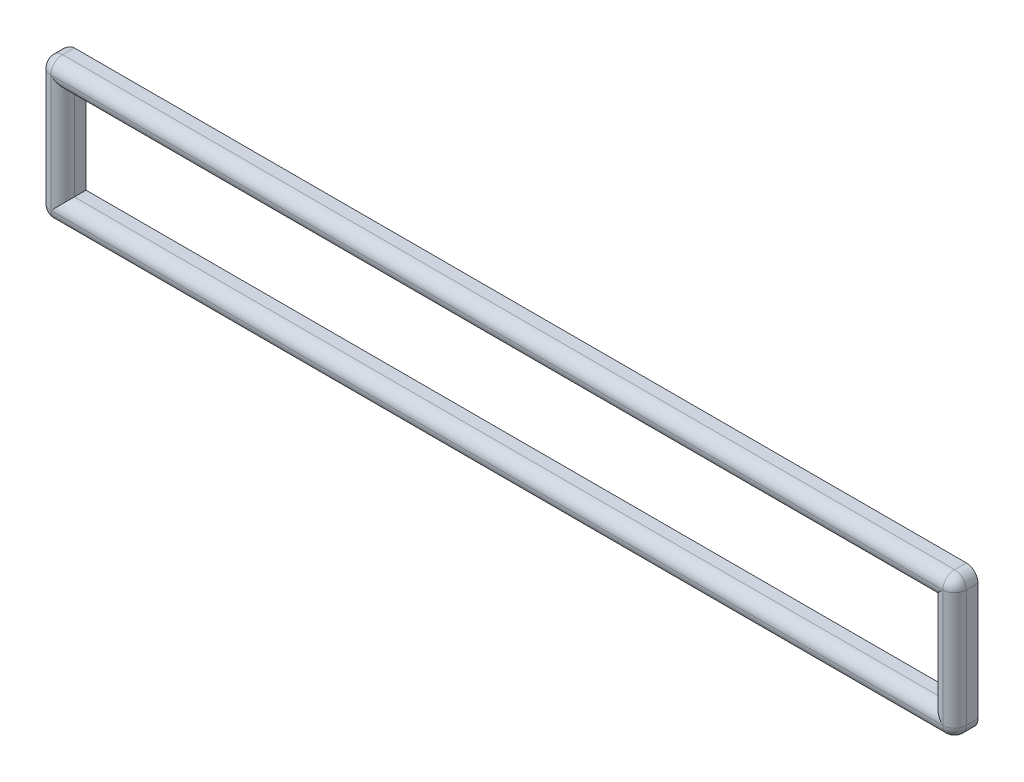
ISO-10303-21;
HEADER;
FILE_DESCRIPTION(('STEP AP214'),'2;1');
FILE_NAME('part.step','',(''),(''),'','','');
FILE_SCHEMA(('AUTOMOTIVE_DESIGN { 1 0 10303 214 1 1 1 1 }'));
ENDSEC;
DATA;
#1=APPLICATION_CONTEXT('core data for automotive mechanical design processes');
#2=APPLICATION_PROTOCOL_DEFINITION('international standard','automotive_design',2000,#1);
#3=PRODUCT_CONTEXT('',#1,'mechanical');
#4=PRODUCT('Part','Part','',(#3));
#5=PRODUCT_RELATED_PRODUCT_CATEGORY('part','',(#4));
#6=PRODUCT_DEFINITION_FORMATION('','',#4);
#7=PRODUCT_DEFINITION_CONTEXT('part definition',#1,'design');
#8=PRODUCT_DEFINITION('design','',#6,#7);
#9=PRODUCT_DEFINITION_SHAPE('','',#8);
#10=(LENGTH_UNIT() NAMED_UNIT(*) SI_UNIT(.MILLI.,.METRE.));
#11=(NAMED_UNIT(*) PLANE_ANGLE_UNIT() SI_UNIT($,.RADIAN.));
#12=(NAMED_UNIT(*) SI_UNIT($,.STERADIAN.) SOLID_ANGLE_UNIT());
#13=UNCERTAINTY_MEASURE_WITH_UNIT(LENGTH_MEASURE(1.E-05),#10,'distance_accuracy_value','');
#14=(GEOMETRIC_REPRESENTATION_CONTEXT(3) GLOBAL_UNCERTAINTY_ASSIGNED_CONTEXT((#13)) GLOBAL_UNIT_ASSIGNED_CONTEXT((#10,
#11,#12)) REPRESENTATION_CONTEXT('',''));
#15=CARTESIAN_POINT('',(0.,0.,0.));
#16=DIRECTION('',(0.,0.,1.));
#17=DIRECTION('',(1.,0.,0.));
#18=AXIS2_PLACEMENT_3D('',#15,#16,#17);
#19=CARTESIAN_POINT('',(49.53,7.62,2.54));
#20=DIRECTION('',(-1.,0.,0.));
#21=DIRECTION('',(0.,-1.,0.));
#22=AXIS2_PLACEMENT_3D('',#19,#20,#21);
#23=PLANE('',#22);
#24=DIRECTION('',(0.,1.,0.));
#25=VECTOR('',#24,1.);
#26=CARTESIAN_POINT('',(49.53,-7.62,1.27));
#27=LINE('',#26,#25);
#28=CARTESIAN_POINT('',(49.53,6.35,1.27));
#29=VERTEX_POINT('',#28);
#30=CARTESIAN_POINT('',(49.53,-6.35,1.27));
#31=VERTEX_POINT('',#30);
#32=EDGE_CURVE('E233',#29,#31,#27,.F.);
#33=ORIENTED_EDGE('',*,*,#32,.T.);
#34=DIRECTION('',(0.,0.,-1.));
#35=VECTOR('',#34,1.);
#36=CARTESIAN_POINT('',(49.53,-6.35,2.54));
#37=LINE('',#36,#35);
#38=CARTESIAN_POINT('',(49.53,-6.35,0.));
#39=VERTEX_POINT('',#38);
#40=EDGE_CURVE('E165',#31,#39,#37,.T.);
#41=ORIENTED_EDGE('',*,*,#40,.T.);
#42=DIRECTION('',(0.,1.,0.));
#43=VECTOR('',#42,1.);
#44=CARTESIAN_POINT('',(49.53,7.62,0.));
#45=LINE('',#44,#43);
#46=CARTESIAN_POINT('',(49.53,6.35,0.));
#47=VERTEX_POINT('',#46);
#48=EDGE_CURVE('E155',#39,#47,#45,.T.);
#49=ORIENTED_EDGE('',*,*,#48,.T.);
#50=DIRECTION('',(0.,0.,-1.));
#51=VECTOR('',#50,1.);
#52=CARTESIAN_POINT('',(49.53,6.35,2.54));
#53=LINE('',#52,#51);
#54=EDGE_CURVE('E235',#47,#29,#53,.F.);
#55=ORIENTED_EDGE('',*,*,#54,.T.);
#56=EDGE_LOOP('',(#33,#41,#49,#55));
#57=FACE_BOUND('',#56,.T.);
#58=ADVANCED_FACE('F35',(#57),#23,.F.);
#59=CARTESIAN_POINT('',(-49.53,7.62,2.54));
#60=DIRECTION('',(0.,-1.,0.));
#61=DIRECTION('',(1.,0.,0.));
#62=AXIS2_PLACEMENT_3D('',#59,#60,#61);
#63=PLANE('',#62);
#64=DIRECTION('',(-1.,0.,0.));
#65=VECTOR('',#64,1.);
#66=CARTESIAN_POINT('',(-49.53,7.62,0.));
#67=LINE('',#66,#65);
#68=CARTESIAN_POINT('',(48.26,7.62,0.));
#69=VERTEX_POINT('',#68);
#70=CARTESIAN_POINT('',(-48.26,7.62,0.));
#71=VERTEX_POINT('',#70);
#72=EDGE_CURVE('E200',#69,#71,#67,.T.);
#73=ORIENTED_EDGE('',*,*,#72,.T.);
#74=DIRECTION('',(0.,0.,-1.));
#75=VECTOR('',#74,1.);
#76=CARTESIAN_POINT('',(-48.26,7.62,2.54));
#77=LINE('',#76,#75);
#78=CARTESIAN_POINT('',(-48.26,7.62,1.27));
#79=VERTEX_POINT('',#78);
#80=EDGE_CURVE('E227',#71,#79,#77,.F.);
#81=ORIENTED_EDGE('',*,*,#80,.T.);
#82=DIRECTION('',(-1.,0.,0.));
#83=VECTOR('',#82,1.);
#84=CARTESIAN_POINT('',(49.53,7.62,1.27));
#85=LINE('',#84,#83);
#86=CARTESIAN_POINT('',(48.26,7.62,1.27));
#87=VERTEX_POINT('',#86);
#88=EDGE_CURVE('E209',#79,#87,#85,.F.);
#89=ORIENTED_EDGE('',*,*,#88,.T.);
#90=DIRECTION('',(0.,0.,-1.));
#91=VECTOR('',#90,1.);
#92=CARTESIAN_POINT('',(48.26,7.62,2.54));
#93=LINE('',#92,#91);
#94=EDGE_CURVE('E225',#87,#69,#93,.T.);
#95=ORIENTED_EDGE('',*,*,#94,.T.);
#96=EDGE_LOOP('',(#73,#81,#89,#95));
#97=FACE_BOUND('',#96,.T.);
#98=ADVANCED_FACE('F323',(#97),#63,.F.);
#99=CARTESIAN_POINT('',(-49.53,-7.62,2.54));
#100=DIRECTION('',(0.,1.,0.));
#101=DIRECTION('',(0.,0.,1.));
#102=AXIS2_PLACEMENT_3D('',#99,#100,#101);
#103=PLANE('',#102);
#104=DIRECTION('',(1.,0.,0.));
#105=VECTOR('',#104,1.);
#106=CARTESIAN_POINT('',(-49.53,-7.62,1.27));
#107=LINE('',#106,#105);
#108=CARTESIAN_POINT('',(48.26,-7.62,1.27));
#109=VERTEX_POINT('',#108);
#110=CARTESIAN_POINT('',(-48.26,-7.62,1.27));
#111=VERTEX_POINT('',#110);
#112=EDGE_CURVE('E214',#109,#111,#107,.F.);
#113=ORIENTED_EDGE('',*,*,#112,.T.);
#114=DIRECTION('',(0.,0.,-1.));
#115=VECTOR('',#114,1.);
#116=CARTESIAN_POINT('',(-48.26,-7.62,2.54));
#117=LINE('',#116,#115);
#118=CARTESIAN_POINT('',(-48.26,-7.62,0.));
#119=VERTEX_POINT('',#118);
#120=EDGE_CURVE('E216',#111,#119,#117,.T.);
#121=ORIENTED_EDGE('',*,*,#120,.T.);
#122=DIRECTION('',(1.,0.,0.));
#123=VECTOR('',#122,1.);
#124=CARTESIAN_POINT('',(-49.53,-7.62,0.));
#125=LINE('',#124,#123);
#126=CARTESIAN_POINT('',(48.26,-7.62,0.));
#127=VERTEX_POINT('',#126);
#128=EDGE_CURVE('E203',#119,#127,#125,.T.);
#129=ORIENTED_EDGE('',*,*,#128,.T.);
#130=DIRECTION('',(0.,0.,-1.));
#131=VECTOR('',#130,1.);
#132=CARTESIAN_POINT('',(48.26,-7.62,2.54));
#133=LINE('',#132,#131);
#134=EDGE_CURVE('E212',#127,#109,#133,.F.);
#135=ORIENTED_EDGE('',*,*,#134,.T.);
#136=EDGE_LOOP('',(#113,#121,#129,#135));
#137=FACE_BOUND('',#136,.T.);
#138=ADVANCED_FACE('F303',(#137),#103,.F.);
#139=CARTESIAN_POINT('',(0.,0.,0.));
#140=DIRECTION('',(0.,0.,1.));
#141=DIRECTION('',(1.,0.,0.));
#142=AXIS2_PLACEMENT_3D('',#139,#140,#141);
#143=PLANE('',#142);
#144=DIRECTION('',(1.,0.,0.));
#145=VECTOR('',#144,1.);
#146=CARTESIAN_POINT('',(-46.99,-5.08,0.));
#147=LINE('',#146,#145);
#148=CARTESIAN_POINT('',(-46.99,-5.08,0.));
#149=VERTEX_POINT('',#148);
#150=CARTESIAN_POINT('',(46.99,-5.08,0.));
#151=VERTEX_POINT('',#150);
#152=EDGE_CURVE('E192',#149,#151,#147,.T.);
#153=ORIENTED_EDGE('',*,*,#152,.T.);
#154=DIRECTION('',(0.,1.,0.));
#155=VECTOR('',#154,1.);
#156=CARTESIAN_POINT('',(46.99,5.08,0.));
#157=LINE('',#156,#155);
#158=CARTESIAN_POINT('',(46.99,5.08,0.));
#159=VERTEX_POINT('',#158);
#160=EDGE_CURVE('E153',#151,#159,#157,.T.);
#161=ORIENTED_EDGE('',*,*,#160,.T.);
#162=DIRECTION('',(-1.,0.,0.));
#163=VECTOR('',#162,1.);
#164=CARTESIAN_POINT('',(-46.99,5.08,0.));
#165=LINE('',#164,#163);
#166=CARTESIAN_POINT('',(-46.99,5.08,0.));
#167=VERTEX_POINT('',#166);
#168=EDGE_CURVE('E183',#159,#167,#165,.T.);
#169=ORIENTED_EDGE('',*,*,#168,.T.);
#170=DIRECTION('',(0.,-1.,0.));
#171=VECTOR('',#170,1.);
#172=CARTESIAN_POINT('',(-46.99,5.08,0.));
#173=LINE('',#172,#171);
#174=EDGE_CURVE('E187',#167,#149,#173,.T.);
#175=ORIENTED_EDGE('',*,*,#174,.T.);
#176=EDGE_LOOP('',(#153,#161,#169,#175));
#177=FACE_BOUND('',#176,.T.);
#178=ORIENTED_EDGE('',*,*,#128,.F.);
#179=DIRECTION('',(0.,-1.,0.));
#180=VECTOR('',#179,1.);
#181=CARTESIAN_POINT('',(-48.26,0.,0.));
#182=LINE('',#181,#180);
#183=EDGE_CURVE('E223',#119,#71,#182,.F.);
#184=ORIENTED_EDGE('',*,*,#183,.T.);
#185=ORIENTED_EDGE('',*,*,#72,.F.);
#186=CARTESIAN_POINT('',(48.26,6.35,0.));
#187=DIRECTION('',(0.,0.,1.));
#188=DIRECTION('',(1.,0.,0.));
#189=AXIS2_PLACEMENT_3D('',#186,#187,#188);
#190=CIRCLE('',#189,1.27);
#191=EDGE_CURVE('E219',#69,#47,#190,.F.);
#192=ORIENTED_EDGE('',*,*,#191,.T.);
#193=ORIENTED_EDGE('',*,*,#48,.F.);
#194=CARTESIAN_POINT('',(48.26,-6.35,0.));
#195=DIRECTION('',(0.,0.,1.));
#196=DIRECTION('',(1.,0.,0.));
#197=AXIS2_PLACEMENT_3D('',#194,#195,#196);
#198=CIRCLE('',#197,1.27);
#199=EDGE_CURVE('E221',#39,#127,#198,.F.);
#200=ORIENTED_EDGE('',*,*,#199,.T.);
#201=EDGE_LOOP('',(#178,#184,#185,#192,#193,#200));
#202=FACE_BOUND('',#201,.T.);
#203=ADVANCED_FACE('F300',(#177,#202),#143,.F.);
#204=CARTESIAN_POINT('',(46.99,5.08,0.));
#205=DIRECTION('',(1.,0.,0.));
#206=DIRECTION('',(0.,0.,-1.));
#207=AXIS2_PLACEMENT_3D('',#204,#205,#206);
#208=PLANE('',#207);
#209=DIRECTION('',(0.,0.,1.));
#210=VECTOR('',#209,1.);
#211=CARTESIAN_POINT('',(46.99,-5.08,0.));
#212=LINE('',#211,#210);
#213=CARTESIAN_POINT('',(46.99,-5.08,1.27));
#214=VERTEX_POINT('',#213);
#215=EDGE_CURVE('E146',#151,#214,#212,.T.);
#216=ORIENTED_EDGE('',*,*,#215,.T.);
#217=DIRECTION('',(0.,1.,0.));
#218=VECTOR('',#217,1.);
#219=CARTESIAN_POINT('',(46.99,5.08,1.27));
#220=LINE('',#219,#218);
#221=CARTESIAN_POINT('',(46.99,5.08,1.27));
#222=VERTEX_POINT('',#221);
#223=EDGE_CURVE('E151',#214,#222,#220,.T.);
#224=ORIENTED_EDGE('',*,*,#223,.T.);
#225=DIRECTION('',(0.,0.,1.));
#226=VECTOR('',#225,1.);
#227=CARTESIAN_POINT('',(46.99,5.08,0.));
#228=LINE('',#227,#226);
#229=EDGE_CURVE('E88',#159,#222,#228,.T.);
#230=ORIENTED_EDGE('',*,*,#229,.F.);
#231=ORIENTED_EDGE('',*,*,#160,.F.);
#232=EDGE_LOOP('',(#216,#224,#230,#231));
#233=FACE_BOUND('',#232,.T.);
#234=ADVANCED_FACE('F150',(#233),#208,.F.);
#235=CARTESIAN_POINT('',(-46.99,-5.08,0.));
#236=DIRECTION('',(0.,-1.,0.));
#237=DIRECTION('',(0.,0.,-1.));
#238=AXIS2_PLACEMENT_3D('',#235,#236,#237);
#239=PLANE('',#238);
#240=DIRECTION('',(0.,0.,1.));
#241=VECTOR('',#240,1.);
#242=CARTESIAN_POINT('',(-46.99,-5.08,0.));
#243=LINE('',#242,#241);
#244=CARTESIAN_POINT('',(-46.99,-5.08,1.27));
#245=VERTEX_POINT('',#244);
#246=EDGE_CURVE('E147',#149,#245,#243,.T.);
#247=ORIENTED_EDGE('',*,*,#246,.T.);
#248=DIRECTION('',(1.,0.,0.));
#249=VECTOR('',#248,1.);
#250=CARTESIAN_POINT('',(46.99,-5.08,1.27));
#251=LINE('',#250,#249);
#252=EDGE_CURVE('E11',#245,#214,#251,.T.);
#253=ORIENTED_EDGE('',*,*,#252,.T.);
#254=ORIENTED_EDGE('',*,*,#215,.F.);
#255=ORIENTED_EDGE('',*,*,#152,.F.);
#256=EDGE_LOOP('',(#247,#253,#254,#255));
#257=FACE_BOUND('',#256,.T.);
#258=ADVANCED_FACE('F144',(#257),#239,.F.);
#259=CARTESIAN_POINT('',(-46.99,5.08,0.));
#260=DIRECTION('',(-1.,0.,0.));
#261=DIRECTION('',(0.,0.,1.));
#262=AXIS2_PLACEMENT_3D('',#259,#260,#261);
#263=PLANE('',#262);
#264=DIRECTION('',(0.,0.,1.));
#265=VECTOR('',#264,1.);
#266=CARTESIAN_POINT('',(-46.99,5.08,0.));
#267=LINE('',#266,#265);
#268=CARTESIAN_POINT('',(-46.99,5.08,1.27));
#269=VERTEX_POINT('',#268);
#270=EDGE_CURVE('E195',#167,#269,#267,.T.);
#271=ORIENTED_EDGE('',*,*,#270,.T.);
#272=DIRECTION('',(0.,-1.,0.));
#273=VECTOR('',#272,1.);
#274=CARTESIAN_POINT('',(-46.99,-5.08,1.27));
#275=LINE('',#274,#273);
#276=EDGE_CURVE('E45',#269,#245,#275,.T.);
#277=ORIENTED_EDGE('',*,*,#276,.T.);
#278=ORIENTED_EDGE('',*,*,#246,.F.);
#279=ORIENTED_EDGE('',*,*,#174,.F.);
#280=EDGE_LOOP('',(#271,#277,#278,#279));
#281=FACE_BOUND('',#280,.T.);
#282=ADVANCED_FACE('F299',(#281),#263,.F.);
#283=CARTESIAN_POINT('',(-46.99,5.08,0.));
#284=DIRECTION('',(0.,1.,0.));
#285=DIRECTION('',(0.,0.,1.));
#286=AXIS2_PLACEMENT_3D('',#283,#284,#285);
#287=PLANE('',#286);
#288=ORIENTED_EDGE('',*,*,#229,.T.);
#289=DIRECTION('',(-1.,0.,0.));
#290=VECTOR('',#289,1.);
#291=CARTESIAN_POINT('',(-46.99,5.08,1.27));
#292=LINE('',#291,#290);
#293=EDGE_CURVE('E164',#222,#269,#292,.T.);
#294=ORIENTED_EDGE('',*,*,#293,.T.);
#295=ORIENTED_EDGE('',*,*,#270,.F.);
#296=ORIENTED_EDGE('',*,*,#168,.F.);
#297=EDGE_LOOP('',(#288,#294,#295,#296));
#298=FACE_BOUND('',#297,.T.);
#299=ADVANCED_FACE('F298',(#298),#287,.F.);
#300=CARTESIAN_POINT('',(0.,6.35,1.27));
#301=DIRECTION('',(1.,0.,0.));
#302=DIRECTION('',(0.,1.,0.));
#303=AXIS2_PLACEMENT_3D('',#300,#301,#302);
#304=CYLINDRICAL_SURFACE('',#303,1.27);
#305=ORIENTED_EDGE('',*,*,#88,.F.);
#306=CARTESIAN_POINT('',(-48.26,6.35,1.27));
#307=DIRECTION('',(1.,0.,0.));
#308=DIRECTION('',(0.,1.,0.));
#309=AXIS2_PLACEMENT_3D('',#306,#307,#308);
#310=CIRCLE('',#309,1.27);
#311=CARTESIAN_POINT('',(-48.26,6.35,2.54));
#312=VERTEX_POINT('',#311);
#313=EDGE_CURVE('E231',#79,#312,#310,.T.);
#314=ORIENTED_EDGE('',*,*,#313,.T.);
#315=DIRECTION('',(-1.,0.,0.));
#316=VECTOR('',#315,1.);
#317=CARTESIAN_POINT('',(-49.53,6.35,2.54));
#318=LINE('',#317,#316);
#319=CARTESIAN_POINT('',(48.26,6.35,2.54));
#320=VERTEX_POINT('',#319);
#321=EDGE_CURVE('E206',#320,#312,#318,.T.);
#322=ORIENTED_EDGE('',*,*,#321,.F.);
#323=CARTESIAN_POINT('',(48.26,6.35,1.27));
#324=DIRECTION('',(1.,0.,0.));
#325=DIRECTION('',(0.,1.,0.));
#326=AXIS2_PLACEMENT_3D('',#323,#324,#325);
#327=CIRCLE('',#326,1.27);
#328=EDGE_CURVE('E229',#320,#87,#327,.F.);
#329=ORIENTED_EDGE('',*,*,#328,.T.);
#330=EDGE_LOOP('',(#305,#314,#322,#329));
#331=FACE_BOUND('',#330,.T.);
#332=ADVANCED_FACE('F325',(#331),#304,.T.);
#333=CARTESIAN_POINT('',(48.26,6.35,2.54));
#334=DIRECTION('',(0.,0.,-1.));
#335=DIRECTION('',(-1.,0.,0.));
#336=AXIS2_PLACEMENT_3D('',#333,#334,#335);
#337=CYLINDRICAL_SURFACE('',#336,1.27);
#338=ORIENTED_EDGE('',*,*,#191,.F.);
#339=ORIENTED_EDGE('',*,*,#94,.F.);
#340=CARTESIAN_POINT('',(48.26,6.35,1.27));
#341=DIRECTION('',(0.,0.,1.));
#342=DIRECTION('',(1.,0.,0.));
#343=AXIS2_PLACEMENT_3D('',#340,#341,#342);
#344=CIRCLE('',#343,1.27);
#345=EDGE_CURVE('E39',#29,#87,#344,.T.);
#346=ORIENTED_EDGE('',*,*,#345,.F.);
#347=ORIENTED_EDGE('',*,*,#54,.F.);
#348=EDGE_LOOP('',(#338,#339,#346,#347));
#349=FACE_BOUND('',#348,.T.);
#350=ADVANCED_FACE('F37',(#349),#337,.T.);
#351=CARTESIAN_POINT('',(48.26,6.35,1.27));
#352=DIRECTION('',(-1.,0.,0.));
#353=DIRECTION('',(0.,-1.,0.));
#354=AXIS2_PLACEMENT_3D('',#351,#352,#353);
#355=SPHERICAL_SURFACE('',#354,1.27);
#356=ORIENTED_EDGE('',*,*,#345,.T.);
#357=ORIENTED_EDGE('',*,*,#328,.F.);
#358=CARTESIAN_POINT('',(48.26,6.35,1.27));
#359=DIRECTION('',(0.,-1.,0.));
#360=DIRECTION('',(1.,0.,0.));
#361=AXIS2_PLACEMENT_3D('',#358,#359,#360);
#362=CIRCLE('',#361,1.27);
#363=EDGE_CURVE('E172',#29,#320,#362,.T.);
#364=ORIENTED_EDGE('',*,*,#363,.F.);
#365=EDGE_LOOP('',(#356,#357,#364));
#366=FACE_BOUND('',#365,.T.);
#367=ADVANCED_FACE('F290',(#366),#355,.T.);
#368=CARTESIAN_POINT('',(48.26,5.08,1.27));
#369=DIRECTION('',(0.,-1.,0.));
#370=DIRECTION('',(0.,0.,-1.));
#371=AXIS2_PLACEMENT_3D('',#368,#369,#370);
#372=CYLINDRICAL_SURFACE('',#371,1.27);
#373=DIRECTION('',(0.,1.,0.));
#374=VECTOR('',#373,1.);
#375=CARTESIAN_POINT('',(48.26,-5.08,2.54));
#376=LINE('',#375,#374);
#377=CARTESIAN_POINT('',(48.26,-6.35,2.54));
#378=VERTEX_POINT('',#377);
#379=EDGE_CURVE('E79',#320,#378,#376,.F.);
#380=ORIENTED_EDGE('',*,*,#379,.F.);
#381=CARTESIAN_POINT('',(48.26,6.35,1.27));
#382=DIRECTION('',(0.707106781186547,-0.707106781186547,0.));
#383=DIRECTION('',(-0.707106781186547,-0.707106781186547,0.));
#384=AXIS2_PLACEMENT_3D('',#381,#382,#383);
#385=ELLIPSE('',#384,1.79605122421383,1.27);
#386=EDGE_CURVE('E163',#222,#320,#385,.F.);
#387=ORIENTED_EDGE('',*,*,#386,.F.);
#388=ORIENTED_EDGE('',*,*,#223,.F.);
#389=CARTESIAN_POINT('',(48.26,-6.35,1.27));
#390=DIRECTION('',(-0.707106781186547,-0.707106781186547,0.));
#391=DIRECTION('',(0.707106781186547,-0.707106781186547,0.));
#392=AXIS2_PLACEMENT_3D('',#389,#390,#391);
#393=ELLIPSE('',#392,1.79605122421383,1.27);
#394=EDGE_CURVE('E160',#378,#214,#393,.T.);
#395=ORIENTED_EDGE('',*,*,#394,.F.);
#396=EDGE_LOOP('',(#380,#387,#388,#395));
#397=FACE_BOUND('',#396,.T.);
#398=ADVANCED_FACE('F159',(#397),#372,.T.);
#399=CARTESIAN_POINT('',(48.26,0.,1.27));
#400=DIRECTION('',(0.,-1.,0.));
#401=DIRECTION('',(1.,0.,0.));
#402=AXIS2_PLACEMENT_3D('',#399,#400,#401);
#403=CYLINDRICAL_SURFACE('',#402,1.27);
#404=ORIENTED_EDGE('',*,*,#363,.T.);
#405=ORIENTED_EDGE('',*,*,#379,.T.);
#406=CARTESIAN_POINT('',(48.26,-6.35,1.27));
#407=DIRECTION('',(0.,-1.,0.));
#408=DIRECTION('',(0.,0.,-1.));
#409=AXIS2_PLACEMENT_3D('',#406,#407,#408);
#410=CIRCLE('',#409,1.27);
#411=EDGE_CURVE('E170',#31,#378,#410,.T.);
#412=ORIENTED_EDGE('',*,*,#411,.F.);
#413=ORIENTED_EDGE('',*,*,#32,.F.);
#414=EDGE_LOOP('',(#404,#405,#412,#413));
#415=FACE_BOUND('',#414,.T.);
#416=ADVANCED_FACE('F285',(#415),#403,.T.);
#417=CARTESIAN_POINT('',(48.26,-6.35,2.54));
#418=DIRECTION('',(0.,0.,-1.));
#419=DIRECTION('',(-1.,0.,0.));
#420=AXIS2_PLACEMENT_3D('',#417,#418,#419);
#421=CYLINDRICAL_SURFACE('',#420,1.27);
#422=ORIENTED_EDGE('',*,*,#199,.F.);
#423=ORIENTED_EDGE('',*,*,#40,.F.);
#424=CARTESIAN_POINT('',(48.26,-6.35,1.27));
#425=DIRECTION('',(0.,0.,1.));
#426=DIRECTION('',(1.,0.,0.));
#427=AXIS2_PLACEMENT_3D('',#424,#425,#426);
#428=CIRCLE('',#427,1.27);
#429=EDGE_CURVE('E174',#109,#31,#428,.T.);
#430=ORIENTED_EDGE('',*,*,#429,.F.);
#431=ORIENTED_EDGE('',*,*,#134,.F.);
#432=EDGE_LOOP('',(#422,#423,#430,#431));
#433=FACE_BOUND('',#432,.T.);
#434=ADVANCED_FACE('F281',(#433),#421,.T.);
#435=CARTESIAN_POINT('',(-46.99,6.35,1.27));
#436=DIRECTION('',(1.,0.,0.));
#437=DIRECTION('',(0.,0.,-1.));
#438=AXIS2_PLACEMENT_3D('',#435,#436,#437);
#439=CYLINDRICAL_SURFACE('',#438,1.27);
#440=ORIENTED_EDGE('',*,*,#386,.T.);
#441=ORIENTED_EDGE('',*,*,#321,.T.);
#442=CARTESIAN_POINT('',(-48.26,6.35,1.27));
#443=DIRECTION('',(0.707106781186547,0.707106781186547,0.));
#444=DIRECTION('',(0.707106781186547,-0.707106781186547,0.));
#445=AXIS2_PLACEMENT_3D('',#442,#443,#444);
#446=ELLIPSE('',#445,1.79605122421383,1.27);
#447=EDGE_CURVE('E269',#269,#312,#446,.F.);
#448=ORIENTED_EDGE('',*,*,#447,.F.);
#449=ORIENTED_EDGE('',*,*,#293,.F.);
#450=EDGE_LOOP('',(#440,#441,#448,#449));
#451=FACE_BOUND('',#450,.T.);
#452=ADVANCED_FACE('F294',(#451),#439,.T.);
#453=CARTESIAN_POINT('',(-46.99,-6.35,1.27));
#454=DIRECTION('',(-1.,0.,0.));
#455=DIRECTION('',(0.,0.,1.));
#456=AXIS2_PLACEMENT_3D('',#453,#454,#455);
#457=CYLINDRICAL_SURFACE('',#456,1.27);
#458=ORIENTED_EDGE('',*,*,#394,.T.);
#459=ORIENTED_EDGE('',*,*,#252,.F.);
#460=CARTESIAN_POINT('',(-48.26,-6.35,1.27));
#461=DIRECTION('',(-0.707106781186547,0.707106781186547,0.));
#462=DIRECTION('',(0.707106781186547,0.707106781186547,0.));
#463=AXIS2_PLACEMENT_3D('',#460,#461,#462);
#464=ELLIPSE('',#463,1.79605122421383,1.27);
#465=CARTESIAN_POINT('',(-48.26,-6.35,2.54));
#466=VERTEX_POINT('',#465);
#467=EDGE_CURVE('E71',#466,#245,#464,.T.);
#468=ORIENTED_EDGE('',*,*,#467,.F.);
#469=DIRECTION('',(1.,0.,0.));
#470=VECTOR('',#469,1.);
#471=CARTESIAN_POINT('',(-46.99,-6.35,2.54));
#472=LINE('',#471,#470);
#473=EDGE_CURVE('E168',#378,#466,#472,.F.);
#474=ORIENTED_EDGE('',*,*,#473,.F.);
#475=EDGE_LOOP('',(#458,#459,#468,#474));
#476=FACE_BOUND('',#475,.T.);
#477=ADVANCED_FACE('F167',(#476),#457,.T.);
#478=CARTESIAN_POINT('',(48.26,-6.35,1.27));
#479=DIRECTION('',(0.,0.,1.));
#480=DIRECTION('',(1.,0.,0.));
#481=AXIS2_PLACEMENT_3D('',#478,#479,#480);
#482=SPHERICAL_SURFACE('',#481,1.27);
#483=ORIENTED_EDGE('',*,*,#429,.T.);
#484=ORIENTED_EDGE('',*,*,#411,.T.);
#485=CARTESIAN_POINT('',(48.26,-6.35,1.27));
#486=DIRECTION('',(1.,0.,0.));
#487=DIRECTION('',(0.,1.,0.));
#488=AXIS2_PLACEMENT_3D('',#485,#486,#487);
#489=CIRCLE('',#488,1.27);
#490=EDGE_CURVE('E265',#109,#378,#489,.F.);
#491=ORIENTED_EDGE('',*,*,#490,.F.);
#492=EDGE_LOOP('',(#483,#484,#491));
#493=FACE_BOUND('',#492,.T.);
#494=ADVANCED_FACE('F275',(#493),#482,.T.);
#495=CARTESIAN_POINT('',(-48.26,6.35,1.27));
#496=DIRECTION('',(1.,0.,0.));
#497=DIRECTION('',(0.,0.,-1.));
#498=AXIS2_PLACEMENT_3D('',#495,#496,#497);
#499=SPHERICAL_SURFACE('',#498,1.27);
#500=CARTESIAN_POINT('',(-48.26,6.35,1.27));
#501=DIRECTION('',(0.,-1.,0.));
#502=DIRECTION('',(0.,0.,-1.));
#503=AXIS2_PLACEMENT_3D('',#500,#501,#502);
#504=CIRCLE('',#503,1.27);
#505=CARTESIAN_POINT('',(-49.53,6.35,1.27));
#506=VERTEX_POINT('',#505);
#507=EDGE_CURVE('E259',#312,#506,#504,.T.);
#508=ORIENTED_EDGE('',*,*,#507,.F.);
#509=ORIENTED_EDGE('',*,*,#313,.F.);
#510=CARTESIAN_POINT('',(-48.26,6.35,1.27));
#511=DIRECTION('',(0.,0.,-1.));
#512=DIRECTION('',(-1.,0.,0.));
#513=AXIS2_PLACEMENT_3D('',#510,#511,#512);
#514=CIRCLE('',#513,1.27);
#515=EDGE_CURVE('E262',#506,#79,#514,.T.);
#516=ORIENTED_EDGE('',*,*,#515,.F.);
#517=EDGE_LOOP('',(#508,#509,#516));
#518=FACE_BOUND('',#517,.T.);
#519=ADVANCED_FACE('F328',(#518),#499,.T.);
#520=CARTESIAN_POINT('',(-48.26,5.08,1.27));
#521=DIRECTION('',(0.,1.,0.));
#522=DIRECTION('',(0.,0.,1.));
#523=AXIS2_PLACEMENT_3D('',#520,#521,#522);
#524=CYLINDRICAL_SURFACE('',#523,1.27);
#525=ORIENTED_EDGE('',*,*,#276,.F.);
#526=ORIENTED_EDGE('',*,*,#447,.T.);
#527=DIRECTION('',(0.,-1.,0.));
#528=VECTOR('',#527,1.);
#529=CARTESIAN_POINT('',(-48.26,5.08,2.54));
#530=LINE('',#529,#528);
#531=EDGE_CURVE('E256',#466,#312,#530,.F.);
#532=ORIENTED_EDGE('',*,*,#531,.F.);
#533=ORIENTED_EDGE('',*,*,#467,.T.);
#534=EDGE_LOOP('',(#525,#526,#532,#533));
#535=FACE_BOUND('',#534,.T.);
#536=ADVANCED_FACE('F334',(#535),#524,.T.);
#537=CARTESIAN_POINT('',(0.,-6.35,1.27));
#538=DIRECTION('',(-1.,0.,0.));
#539=DIRECTION('',(0.,0.,1.));
#540=AXIS2_PLACEMENT_3D('',#537,#538,#539);
#541=CYLINDRICAL_SURFACE('',#540,1.27);
#542=ORIENTED_EDGE('',*,*,#490,.T.);
#543=ORIENTED_EDGE('',*,*,#473,.T.);
#544=CARTESIAN_POINT('',(-48.26,-6.35,1.27));
#545=DIRECTION('',(-1.,0.,0.));
#546=DIRECTION('',(0.,0.,1.));
#547=AXIS2_PLACEMENT_3D('',#544,#545,#546);
#548=CIRCLE('',#547,1.27);
#549=EDGE_CURVE('E251',#111,#466,#548,.T.);
#550=ORIENTED_EDGE('',*,*,#549,.F.);
#551=ORIENTED_EDGE('',*,*,#112,.F.);
#552=EDGE_LOOP('',(#542,#543,#550,#551));
#553=FACE_BOUND('',#552,.T.);
#554=ADVANCED_FACE('F336',(#553),#541,.T.);
#555=CARTESIAN_POINT('',(-48.26,6.35,2.54));
#556=DIRECTION('',(0.,0.,-1.));
#557=DIRECTION('',(-1.,0.,0.));
#558=AXIS2_PLACEMENT_3D('',#555,#556,#557);
#559=CYLINDRICAL_SURFACE('',#558,1.27);
#560=ORIENTED_EDGE('',*,*,#515,.T.);
#561=ORIENTED_EDGE('',*,*,#80,.F.);
#562=CARTESIAN_POINT('',(-48.26,6.35,1.27));
#563=DIRECTION('',(0.,-0.707106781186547,-0.707106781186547));
#564=DIRECTION('',(0.,0.707106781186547,-0.707106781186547));
#565=AXIS2_PLACEMENT_3D('',#562,#563,#564);
#566=ELLIPSE('',#565,1.79605122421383,1.27);
#567=EDGE_CURVE('E248',#506,#71,#566,.T.);
#568=ORIENTED_EDGE('',*,*,#567,.F.);
#569=EDGE_LOOP('',(#560,#561,#568));
#570=FACE_BOUND('',#569,.T.);
#571=ADVANCED_FACE('F321',(#570),#559,.T.);
#572=CARTESIAN_POINT('',(-48.26,0.,1.27));
#573=DIRECTION('',(0.,1.,0.));
#574=DIRECTION('',(0.,0.,1.));
#575=AXIS2_PLACEMENT_3D('',#572,#573,#574);
#576=CYLINDRICAL_SURFACE('',#575,1.27);
#577=CARTESIAN_POINT('',(-48.26,-6.35,1.27));
#578=DIRECTION('',(0.,-1.,0.));
#579=DIRECTION('',(0.,0.,-1.));
#580=AXIS2_PLACEMENT_3D('',#577,#578,#579);
#581=CIRCLE('',#580,1.27);
#582=CARTESIAN_POINT('',(-49.53,-6.35,1.27));
#583=VERTEX_POINT('',#582);
#584=EDGE_CURVE('E254',#466,#583,#581,.T.);
#585=ORIENTED_EDGE('',*,*,#584,.F.);
#586=ORIENTED_EDGE('',*,*,#531,.T.);
#587=ORIENTED_EDGE('',*,*,#507,.T.);
#588=DIRECTION('',(0.,-1.,0.));
#589=VECTOR('',#588,1.);
#590=CARTESIAN_POINT('',(-49.53,6.35,1.27));
#591=LINE('',#590,#589);
#592=EDGE_CURVE('E245',#583,#506,#591,.F.);
#593=ORIENTED_EDGE('',*,*,#592,.F.);
#594=EDGE_LOOP('',(#585,#586,#587,#593));
#595=FACE_BOUND('',#594,.T.);
#596=ADVANCED_FACE('F332',(#595),#576,.T.);
#597=CARTESIAN_POINT('',(-48.26,-6.35,1.27));
#598=DIRECTION('',(0.,0.,1.));
#599=DIRECTION('',(1.,0.,0.));
#600=AXIS2_PLACEMENT_3D('',#597,#598,#599);
#601=SPHERICAL_SURFACE('',#600,1.27);
#602=ORIENTED_EDGE('',*,*,#549,.T.);
#603=ORIENTED_EDGE('',*,*,#584,.T.);
#604=CARTESIAN_POINT('',(-48.26,-6.35,1.27));
#605=DIRECTION('',(0.,0.,1.));
#606=DIRECTION('',(1.,0.,0.));
#607=AXIS2_PLACEMENT_3D('',#604,#605,#606);
#608=CIRCLE('',#607,1.27);
#609=EDGE_CURVE('E242',#111,#583,#608,.F.);
#610=ORIENTED_EDGE('',*,*,#609,.F.);
#611=EDGE_LOOP('',(#602,#603,#610));
#612=FACE_BOUND('',#611,.T.);
#613=ADVANCED_FACE('F359',(#612),#601,.T.);
#614=CARTESIAN_POINT('',(-48.26,7.62,1.27));
#615=DIRECTION('',(0.,-1.,0.));
#616=DIRECTION('',(0.,0.,-1.));
#617=AXIS2_PLACEMENT_3D('',#614,#615,#616);
#618=CYLINDRICAL_SURFACE('',#617,1.27);
#619=ORIENTED_EDGE('',*,*,#567,.T.);
#620=ORIENTED_EDGE('',*,*,#183,.F.);
#621=CARTESIAN_POINT('',(-48.26,-6.35,1.27));
#622=DIRECTION('',(0.,-0.707106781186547,0.707106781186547));
#623=DIRECTION('',(0.,-0.707106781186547,-0.707106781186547));
#624=AXIS2_PLACEMENT_3D('',#621,#622,#623);
#625=ELLIPSE('',#624,1.79605122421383,1.27);
#626=EDGE_CURVE('E240',#583,#119,#625,.T.);
#627=ORIENTED_EDGE('',*,*,#626,.F.);
#628=ORIENTED_EDGE('',*,*,#592,.T.);
#629=EDGE_LOOP('',(#619,#620,#627,#628));
#630=FACE_BOUND('',#629,.T.);
#631=ADVANCED_FACE('F316',(#630),#618,.T.);
#632=CARTESIAN_POINT('',(-48.26,-6.35,2.54));
#633=DIRECTION('',(0.,0.,-1.));
#634=DIRECTION('',(-1.,0.,0.));
#635=AXIS2_PLACEMENT_3D('',#632,#633,#634);
#636=CYLINDRICAL_SURFACE('',#635,1.27);
#637=ORIENTED_EDGE('',*,*,#120,.F.);
#638=ORIENTED_EDGE('',*,*,#609,.T.);
#639=ORIENTED_EDGE('',*,*,#626,.T.);
#640=EDGE_LOOP('',(#637,#638,#639));
#641=FACE_BOUND('',#640,.T.);
#642=ADVANCED_FACE('F312',(#641),#636,.T.);
#643=CLOSED_SHELL('',(#58,#98,#138,#203,#234,#258,#282,#299,#332,#350,#367,#398,#416,#434,#452,
#477,#494,#519,#536,#554,#571,#596,#613,#631,#642));
#644=MANIFOLD_SOLID_BREP('B2',#643);
#645=ADVANCED_BREP_SHAPE_REPRESENTATION('',(#18,#644),#14);
#646=SHAPE_DEFINITION_REPRESENTATION(#9,#645);
ENDSEC;
END-ISO-10303-21;
